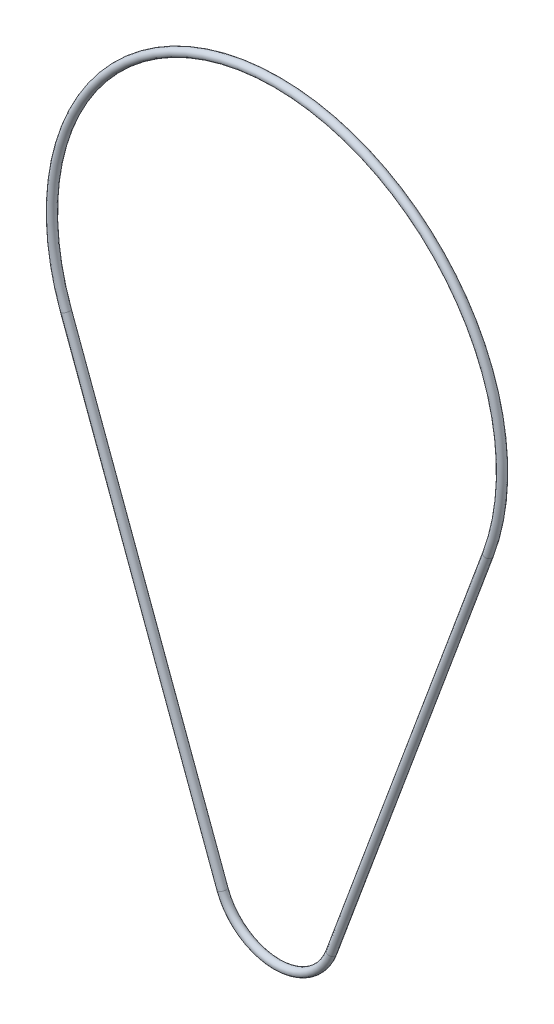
ISO-10303-21;
HEADER;
FILE_DESCRIPTION(('STEP AP214'),'2;1');
FILE_NAME('part.step','',(''),(''),'','','');
FILE_SCHEMA(('AUTOMOTIVE_DESIGN { 1 0 10303 214 1 1 1 1 }'));
ENDSEC;
DATA;
#1=APPLICATION_CONTEXT('core data for automotive mechanical design processes');
#2=APPLICATION_PROTOCOL_DEFINITION('international standard','automotive_design',2000,#1);
#3=PRODUCT_CONTEXT('',#1,'mechanical');
#4=PRODUCT('Part','Part','',(#3));
#5=PRODUCT_RELATED_PRODUCT_CATEGORY('part','',(#4));
#6=PRODUCT_DEFINITION_FORMATION('','',#4);
#7=PRODUCT_DEFINITION_CONTEXT('part definition',#1,'design');
#8=PRODUCT_DEFINITION('design','',#6,#7);
#9=PRODUCT_DEFINITION_SHAPE('','',#8);
#10=(LENGTH_UNIT() NAMED_UNIT(*) SI_UNIT(.MILLI.,.METRE.));
#11=(NAMED_UNIT(*) PLANE_ANGLE_UNIT() SI_UNIT($,.RADIAN.));
#12=(NAMED_UNIT(*) SI_UNIT($,.STERADIAN.) SOLID_ANGLE_UNIT());
#13=UNCERTAINTY_MEASURE_WITH_UNIT(LENGTH_MEASURE(1.E-05),#10,'distance_accuracy_value','');
#14=(GEOMETRIC_REPRESENTATION_CONTEXT(3) GLOBAL_UNCERTAINTY_ASSIGNED_CONTEXT((#13)) GLOBAL_UNIT_ASSIGNED_CONTEXT((#10,
#11,#12)) REPRESENTATION_CONTEXT('',''));
#15=CARTESIAN_POINT('',(0.,0.,0.));
#16=DIRECTION('',(0.,0.,1.));
#17=DIRECTION('',(1.,0.,0.));
#18=AXIS2_PLACEMENT_3D('',#15,#16,#17);
#19=CARTESIAN_POINT('',(0.,-24.,0.));
#20=DIRECTION('',(0.,0.,1.));
#21=DIRECTION('',(1.,0.,0.));
#22=AXIS2_PLACEMENT_3D('',#19,#20,#21);
#23=TOROIDAL_SURFACE('',#22,2.9,0.2);
#24=CARTESIAN_POINT('',(-2.71949577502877,-25.0071458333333,0.));
#25=DIRECTION('',(0.347291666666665,-0.937757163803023,0.));
#26=DIRECTION('',(0.937757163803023,0.347291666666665,0.));
#27=AXIS2_PLACEMENT_3D('',#24,#25,#26);
#28=CIRCLE('',#27,0.2);
#29=CARTESIAN_POINT('',(-2.90704720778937,-25.0766041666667,0.));
#30=VERTEX_POINT('',#29);
#31=EDGE_CURVE('E11',#30,#30,#28,.T.);
#32=CARTESIAN_POINT('',(2.71949577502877,-25.0071458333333,0.));
#33=DIRECTION('',(0.347291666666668,0.937757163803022,0.));
#34=DIRECTION('',(-0.937757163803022,0.347291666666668,0.));
#35=AXIS2_PLACEMENT_3D('',#32,#33,#34);
#36=CIRCLE('',#35,0.2);
#37=CARTESIAN_POINT('',(2.90704720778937,-25.0766041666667,0.));
#38=VERTEX_POINT('',#37);
#39=EDGE_CURVE('E59',#38,#38,#36,.T.);
#40=CARTESIAN_POINT('',(0.,-24.,0.));
#41=DIRECTION('',(0.,0.,1.));
#42=DIRECTION('',(1.,0.,0.));
#43=AXIS2_PLACEMENT_3D('',#40,#41,#42);
#44=CIRCLE('',#43,3.1);
#45=EDGE_CURVE('',#30,#38,#44,.T.);
#46=ORIENTED_EDGE('',*,*,#31,.T.);
#47=ORIENTED_EDGE('',*,*,#39,.F.);
#48=ORIENTED_EDGE('',*,*,#45,.T.);
#49=ORIENTED_EDGE('',*,*,#45,.F.);
#50=EDGE_LOOP('',(#46,#48,#47,#49));
#51=FACE_BOUND('',#50,.T.);
#52=ADVANCED_FACE('F45',(#51),#23,.T.);
#53=CARTESIAN_POINT('',(-10.535701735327,-3.901821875,0.));
#54=DIRECTION('',(0.347291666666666,-0.937757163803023,0.));
#55=DIRECTION('',(0.937757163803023,0.347291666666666,0.));
#56=AXIS2_PLACEMENT_3D('',#53,#54,#55);
#57=CYLINDRICAL_SURFACE('',#56,0.2);
#58=ORIENTED_EDGE('',*,*,#31,.F.);
#59=EDGE_LOOP('',(#58));
#60=FACE_BOUND('',#59,.T.);
#61=CARTESIAN_POINT('',(-10.535701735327,-3.90182187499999,0.));
#62=DIRECTION('',(0.347291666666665,-0.937757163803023,0.));
#63=DIRECTION('',(0.937757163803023,0.347291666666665,0.));
#64=AXIS2_PLACEMENT_3D('',#61,#62,#63);
#65=CIRCLE('',#64,0.2);
#66=CARTESIAN_POINT('',(-10.7232531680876,-3.97128020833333,0.));
#67=VERTEX_POINT('',#66);
#68=EDGE_CURVE('E51',#67,#67,#65,.T.);
#69=ORIENTED_EDGE('',*,*,#68,.T.);
#70=EDGE_LOOP('',(#69));
#71=FACE_BOUND('',#70,.T.);
#72=ADVANCED_FACE('F68',(#60,#71),#57,.T.);
#73=CARTESIAN_POINT('',(0.,0.,0.));
#74=DIRECTION('',(0.,0.,1.));
#75=DIRECTION('',(1.,0.,0.));
#76=AXIS2_PLACEMENT_3D('',#73,#74,#75);
#77=TOROIDAL_SURFACE('',#76,11.235,0.2);
#78=CARTESIAN_POINT('',(10.535701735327,-3.901821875,0.));
#79=DIRECTION('',(0.347291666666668,0.937757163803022,0.));
#80=DIRECTION('',(-0.937757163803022,0.347291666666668,0.));
#81=AXIS2_PLACEMENT_3D('',#78,#79,#80);
#82=CIRCLE('',#81,0.2);
#83=CARTESIAN_POINT('',(10.7232531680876,-3.97128020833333,0.));
#84=VERTEX_POINT('',#83);
#85=EDGE_CURVE('E55',#84,#84,#82,.T.);
#86=CARTESIAN_POINT('',(0.,0.,0.));
#87=DIRECTION('',(0.,0.,1.));
#88=DIRECTION('',(1.,0.,0.));
#89=AXIS2_PLACEMENT_3D('',#86,#87,#88);
#90=CIRCLE('',#89,11.435);
#91=EDGE_CURVE('',#84,#67,#90,.T.);
#92=ORIENTED_EDGE('',*,*,#85,.T.);
#93=ORIENTED_EDGE('',*,*,#68,.F.);
#94=ORIENTED_EDGE('',*,*,#91,.T.);
#95=ORIENTED_EDGE('',*,*,#91,.F.);
#96=EDGE_LOOP('',(#92,#94,#93,#95));
#97=FACE_BOUND('',#96,.T.);
#98=ADVANCED_FACE('F72',(#97),#77,.T.);
#99=CARTESIAN_POINT('',(2.71949577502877,-25.0071458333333,0.));
#100=DIRECTION('',(0.347291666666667,0.937757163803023,0.));
#101=DIRECTION('',(-0.937757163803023,0.347291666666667,0.));
#102=AXIS2_PLACEMENT_3D('',#99,#100,#101);
#103=CYLINDRICAL_SURFACE('',#102,0.2);
#104=ORIENTED_EDGE('',*,*,#85,.F.);
#105=EDGE_LOOP('',(#104));
#106=FACE_BOUND('',#105,.T.);
#107=ORIENTED_EDGE('',*,*,#39,.T.);
#108=EDGE_LOOP('',(#107));
#109=FACE_BOUND('',#108,.T.);
#110=ADVANCED_FACE('F65',(#106,#109),#103,.T.);
#111=CLOSED_SHELL('',(#52,#72,#98,#110));
#112=MANIFOLD_SOLID_BREP('B2',#111);
#113=ADVANCED_BREP_SHAPE_REPRESENTATION('',(#18,#112),#14);
#114=SHAPE_DEFINITION_REPRESENTATION(#9,#113);
ENDSEC;
END-ISO-10303-21;
